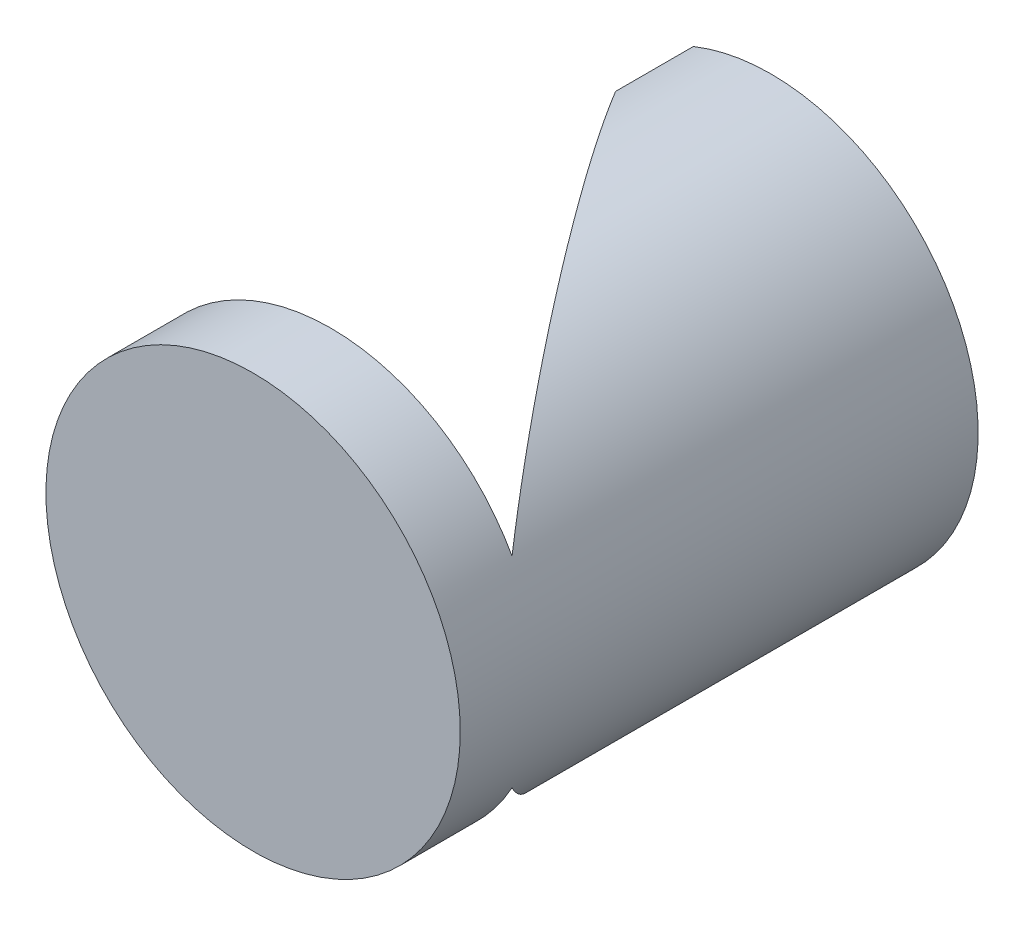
from build123d import *

# Parameters (mm, degrees)
SKETCH_1_R               = 40
EXTRUDE_2_DEPTH          = 100
CUT_EXTRUDE_2_DEPTH      = 115.891252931
CUT_EXTRUDE_2_DEPTH_BACK = 115.891252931


with BuildPart() as part:
    # Sketch 1 → Extrude 2 (new body)
    with BuildSketch(Plane.XY):
        with Locations(Location((0, 0, 0), (0, 0, 180))):
            Circle(SKETCH_1_R)
    extrude(amount=EXTRUDE_2_DEPTH)

    # Sketch 3 → Cut-Extrude 2 (cut, two sides: drawn at the far end of the back side and taken through both)
    with BuildSketch(Plane(origin=(0, 0, 0), x_dir=(1, 0, 0), z_dir=(0, 1, 0)).offset(-CUT_EXTRUDE_2_DEPTH_BACK)):
        Polygon((-40, 0), (-15, 0), (-15, -15), (35, -85), (-40, -85), align=None)
    extrude(amount=CUT_EXTRUDE_2_DEPTH + CUT_EXTRUDE_2_DEPTH_BACK, mode=Mode.SUBTRACT)


solid = part.part
